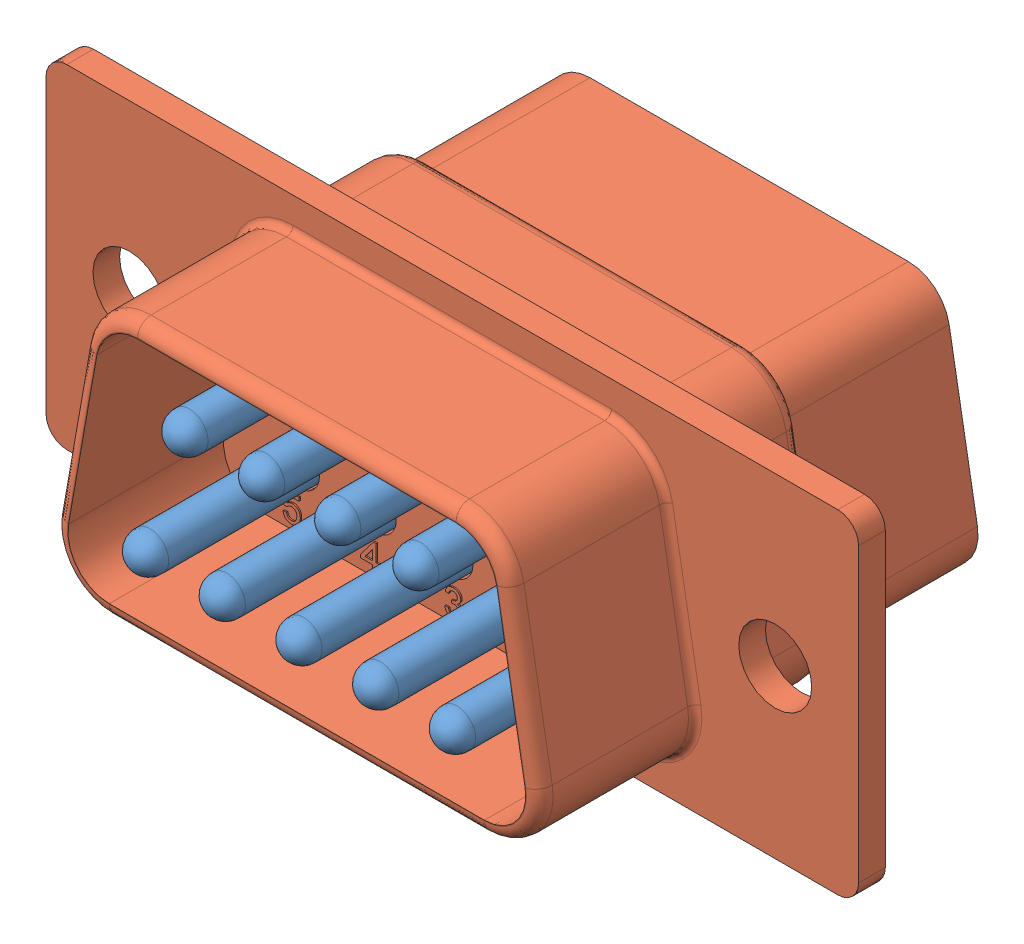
SolidWorks assembly User Library-9pin dconn with pins assy.SLDASM, configuration Default (file format 5000). Lengths in mm.
Overall size (30.94 12.7 17.78).
10 component instances, 2 part files, 18 mates.
Components (placement in the parent):
- User Library-9pin dconn with pins assy_pin-9: User Library-9pin dconn with pins assy_pin.SLDPRT [Default] at (4.3277 -2.2016 0.8882) size (1.91 1.91 17.4)
- User Library-9pin dconn with pins assy_pin-10: User Library-9pin dconn with pins assy_pin.SLDPRT [Default] at (1.4067 -2.2016 0.8882) size (1.91 1.91 17.4)
- User Library-9pin dconn with pins assy_pin-11: User Library-9pin dconn with pins assy_pin.SLDPRT [Default] at (-1.5143 -2.2016 0.8882) size (1.91 1.91 17.4)
- User Library-9pin dconn with pins assy_pin-12: User Library-9pin dconn with pins assy_pin.SLDPRT [Default] at (-4.4353 -2.2016 0.8882) size (1.91 1.91 17.4)
- User Library-9pin dconn with pins assy_pin-13: User Library-9pin dconn with pins assy_pin.SLDPRT [Default] at (-2.9359 2.4974 0.8882) size (1.91 1.91 17.4)
- User Library-9pin dconn with pins assy_pin-14: User Library-9pin dconn with pins assy_pin.SLDPRT [Default] at (-0.0143 2.4974 0.8882) size (1.91 1.91 17.4)
- User Library-9pin dconn with pins assy_pin-15: User Library-9pin dconn with pins assy_pin.SLDPRT [Default] at (2.8803 2.4974 0.8882) size (1.91 1.91 17.4)
- User Library-9pin dconn with pins assy_pin-16: User Library-9pin dconn with pins assy_pin.SLDPRT [Default] at (5.8561 2.4974 0.8882) size (1.91 1.91 17.4)
- User Library-9pin dconn with pins assy_pin-17: User Library-9pin dconn with pins assy_pin.SLDPRT [Default] at (7.2487 -2.2016 0.8882) size (1.91 1.91 17.4)
- User Library-9pin dconn with pins assy_9pin dconn-1: User Library-9pin dconn with pins assy_9pin dconn.SLDPRT [Default] at (1.4067 -6.1386 3.4282) size (30.94 12.7 17.27)
Mates (geometry in assembly coordinates):
- Coincident1: coincident anti-aligned: plane of User Library-9pin dconn with pins assy_9pin dconn-1 through (8.0361 -2.2016 0.8882) normal (0 0 -1); plane of User Library-9pin dconn with pins assy_pin-17 through (7.2487 -2.2016 0.8882) normal (0 0 1)
- Concentric3: concentric aligned: cylinder of User Library-9pin dconn with pins assy_9pin dconn-1 through (7.2487 -2.2016 -7.3668) axis (0 0 -1) radius 1.0541; cylinder of User Library-9pin dconn with pins assy_pin-17 through (7.2487 -2.2016 9.6004) axis (0 0 -1) radius 0.7112
- Coincident2: coincident anti-aligned: circle of User Library-9pin dconn with pins assy_9pin dconn-1; plane of User Library-9pin dconn with pins assy_pin-16 through (5.8561 2.4974 0.8882) normal (0 0 1)
- Concentric4: concentric aligned: cylinder of User Library-9pin dconn with pins assy_9pin dconn-1 through (5.8561 2.4974 -7.3668) axis (0 0 -1) radius 1.0541; cylinder of User Library-9pin dconn with pins assy_pin-16 through (5.8561 2.4974 9.6004) axis (0 0 -1) radius 0.7112
- Coincident3: coincident anti-aligned: plane of User Library-9pin dconn with pins assy_9pin dconn-1 through (3.6677 2.4974 0.8882) normal (0 0 -1); plane of User Library-9pin dconn with pins assy_pin-15 through (2.8803 2.4974 0.8882) normal (0 0 1)
- Concentric5: concentric aligned: cylinder of User Library-9pin dconn with pins assy_9pin dconn-1 through (2.8803 2.4974 -7.3668) axis (0 0 -1) radius 1.0541; cylinder of User Library-9pin dconn with pins assy_pin-15 through (2.8803 2.4974 9.6004) axis (0 0 -1) radius 0.7112
- Coincident4: coincident anti-aligned: plane of User Library-9pin dconn with pins assy_9pin dconn-1 through (0.7731 2.4974 0.8882) normal (0 0 -1); plane of User Library-9pin dconn with pins assy_pin-14 through (-0.0143 2.4974 0.8882) normal (0 0 1)
- Concentric6: concentric anti-aligned: cylinder of User Library-9pin dconn with pins assy_9pin dconn-1 through (-0.0143 2.4974 -7.3668) axis (0 0 -1) radius 1.0541; cylinder of User Library-9pin dconn with pins assy_pin-14 through (-0.0143 2.4974 -3.8616) axis (0 0 1) radius 0.9525
- Coincident5: coincident anti-aligned: plane of User Library-9pin dconn with pins assy_9pin dconn-1 through (-2.1485 2.4974 0.8882) normal (0 0 -1); plane of User Library-9pin dconn with pins assy_pin-13 through (-2.9359 2.4974 0.8882) normal (0 0 1)
- Concentric7: concentric aligned: cylinder of User Library-9pin dconn with pins assy_9pin dconn-1 through (-2.9359 2.4974 -7.3668) axis (0 0 -1) radius 0.7874; cylinder of User Library-9pin dconn with pins assy_pin-13 through (-2.9359 2.4974 9.6004) axis (0 0 -1) radius 0.7112
- Coincident6: coincident anti-aligned: plane of User Library-9pin dconn with pins assy_9pin dconn-1 through (-3.6479 -2.2016 0.8882) normal (0 0 -1); plane of User Library-9pin dconn with pins assy_pin-12 through (-4.4353 -2.2016 0.8882) normal (0 0 1)
- Concentric8: concentric aligned: cylinder of User Library-9pin dconn with pins assy_9pin dconn-1 through (-4.4353 -2.2016 -7.3668) axis (0 0 -1) radius 1.0541; cylinder of User Library-9pin dconn with pins assy_pin-12 through (-4.4353 -2.2016 9.6004) axis (0 0 -1) radius 0.7112
- Coincident7: coincident anti-aligned: plane of User Library-9pin dconn with pins assy_9pin dconn-1 through (-0.7269 -2.2016 0.8882) normal (0 0 -1); plane of User Library-9pin dconn with pins assy_pin-11 through (-1.5143 -2.2016 0.8882) normal (0 0 1)
- Concentric9: concentric aligned: cylinder of User Library-9pin dconn with pins assy_9pin dconn-1 through (-1.5143 -2.2016 -7.3668) axis (0 0 -1) radius 1.0541; cylinder of User Library-9pin dconn with pins assy_pin-11 through (-1.5143 -2.2016 9.6004) axis (0 0 -1) radius 0.7112
- Coincident8: coincident anti-aligned: plane of User Library-9pin dconn with pins assy_9pin dconn-1 through (2.1941 -2.2016 0.8882) normal (0 0 -1); plane of User Library-9pin dconn with pins assy_pin-10 through (1.4067 -2.2016 0.8882) normal (0 0 1)
- Concentric10: concentric aligned: cylinder of User Library-9pin dconn with pins assy_9pin dconn-1 through (1.4067 -2.2016 -7.3668) axis (0 0 -1) radius 1.0541; cylinder of User Library-9pin dconn with pins assy_pin-10 through (1.4067 -2.2016 9.6004) axis (0 0 -1) radius 0.7112
- Coincident9: coincident anti-aligned: plane of User Library-9pin dconn with pins assy_9pin dconn-1 through (5.1151 -2.2016 0.8882) normal (0 0 -1); plane of User Library-9pin dconn with pins assy_pin-9 through (4.3277 -2.2016 0.8882) normal (0 0 1)
- Concentric11: concentric aligned: cylinder of User Library-9pin dconn with pins assy_9pin dconn-1 through (4.3277 -2.2016 -7.3668) axis (0 0 -1) radius 1.0541; cylinder of User Library-9pin dconn with pins assy_pin-9 through (4.3277 -2.2016 9.6004) axis (0 0 -1) radius 0.7112
